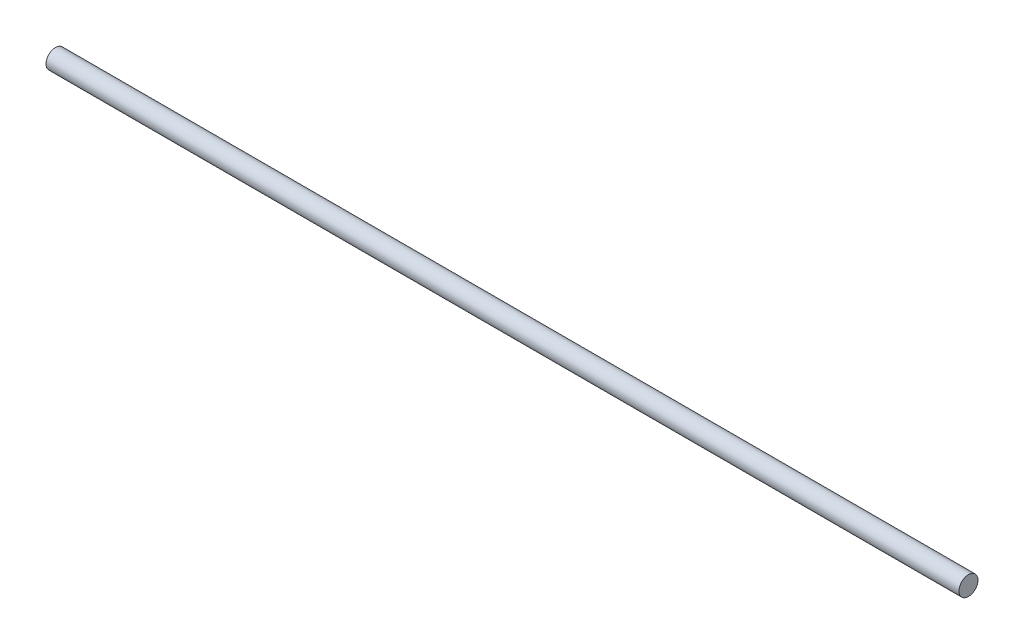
from build123d import *

# Parameters (mm, degrees)
SKETCH2_W = 914.4
SKETCH2_H = 9.525


with BuildPart() as part:
    # Sketch2 → Base-Revolve (revolve)
    with BuildSketch(Plane.XY):
        with Locations((-457.2, 4.7625)):
            Rectangle(SKETCH2_W, SKETCH2_H)
    revolve(axis=Axis((0, 0, 0), (-1, 0, 0)))


solid = part.part
